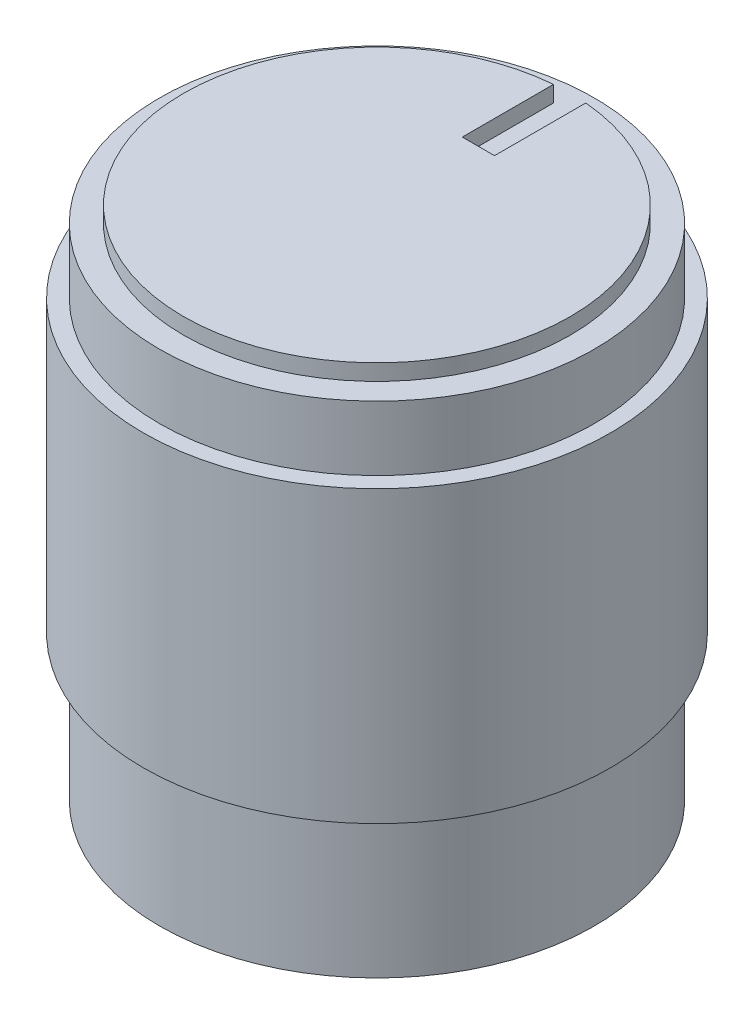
from build123d import *

# Parameters (mm, degrees)
SKETCH_1_R          = 6.75
EXTRUDE_5_DEPTH     = 4.5
SKETCH_7_R          = 7.25
EXTRUDE_6_DEPTH     = 9
SKETCH_8_R          = 6.75
EXTRUDE_7_DEPTH     = 2
SKETCH_9_R          = 6
EXTRUDE_8_DEPTH     = 0.5
SKETCH_10_W         = 1
SKETCH_10_H         = 2.855384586
CUT_EXTRUDE_2_DEPTH = 0.5
SKETCH_11_R         = 6.25
CUT_EXTRUDE_3_DEPTH = 5
SKETCH1_R           = 3
CUT_EXTRUDE1_DEPTH  = 10


with BuildPart() as part:
    # Sketch 1 → Extrude 5 (new body)
    with BuildSketch(Plane(origin=(0, 0, 0), x_dir=(1, 0, 0), z_dir=(0, 1, 0))):
        with Locations(Location((0, 0, 0), (0, 0, 270))):
            Circle(SKETCH_1_R)
    extrude(amount=EXTRUDE_5_DEPTH)

    # Sketch 7 → Extrude 6 (add)
    with BuildSketch(Plane(origin=(0, 4.5, 0), x_dir=(1, 0, 0), z_dir=(0, 1, 0))):
        with Locations(Location((0, 0, 0), (0, 0, 270))):
            Circle(SKETCH_7_R)
    extrude(amount=EXTRUDE_6_DEPTH)

    # Sketch 8 → Extrude 7 (add)
    with BuildSketch(Plane(origin=(0, 13.5, 0), x_dir=(1, 0, 0), z_dir=(0, 1, 0))):
        with Locations(Location((0, 0, 0), (0, 0, 270))):
            Circle(SKETCH_8_R)
    extrude(amount=EXTRUDE_7_DEPTH)

    # Sketch 9 → Extrude 8 (add)
    with BuildSketch(Plane(origin=(0, 15.5, 0), x_dir=(1, 0, 0), z_dir=(0, 1, 0))):
        with Locations(Location((0, 0, 0), (0, 0, 270))):
            Circle(SKETCH_9_R)
    extrude(amount=EXTRUDE_8_DEPTH)

    # Sketch 10 → Cut-Extrude 2 (cut)
    with BuildSketch(Plane(origin=(0, 16, 0), x_dir=(1, 0, 0), z_dir=(0, 1, 0))):
        with Locations((0, 4.575661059)):
            Rectangle(SKETCH_10_W, SKETCH_10_H)
    extrude(amount=-CUT_EXTRUDE_2_DEPTH, mode=Mode.SUBTRACT)

    # Sketch 11 → Cut-Extrude 3 (cut)
    with BuildSketch(Plane.XZ):
        with Locations(Location((0, 0, 0), (0, 0, 270))):
            Circle(SKETCH_11_R)
    extrude(amount=-CUT_EXTRUDE_3_DEPTH, mode=Mode.SUBTRACT)

    # Sketch1 → Cut-Extrude1 (cut)
    with BuildSketch(Plane.XZ.offset(-5)):
        with Locations(Location((0, 0, 0), (0, 0, 270))):
            Circle(SKETCH1_R)
    extrude(amount=-CUT_EXTRUDE1_DEPTH, mode=Mode.SUBTRACT)


solid = part.part
